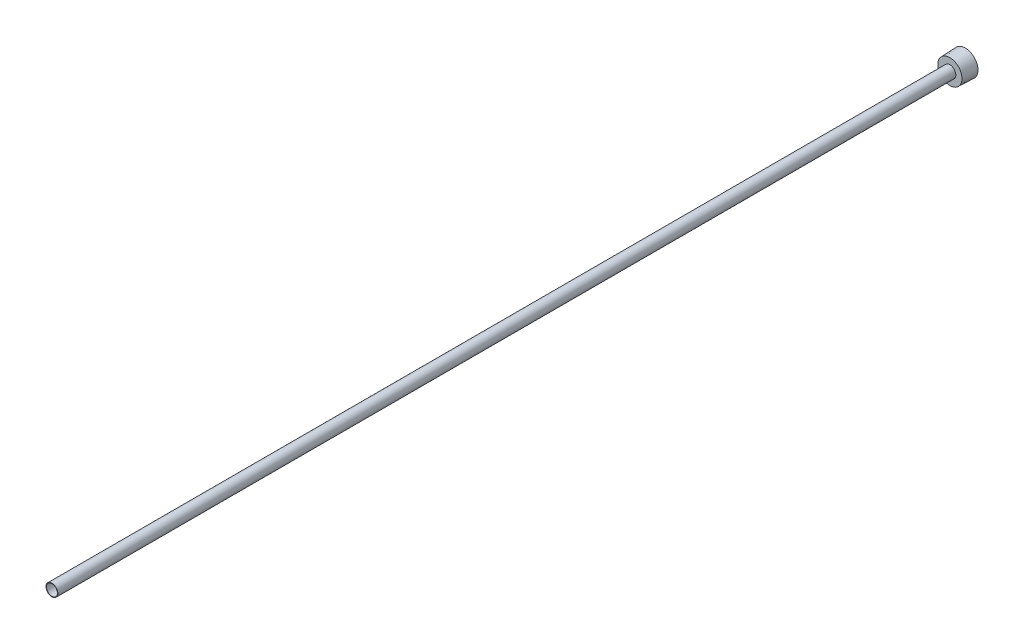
ISO-10303-21;
HEADER;
FILE_DESCRIPTION(('STEP AP214'),'2;1');
FILE_NAME('part.step','',(''),(''),'','','');
FILE_SCHEMA(('AUTOMOTIVE_DESIGN { 1 0 10303 214 1 1 1 1 }'));
ENDSEC;
DATA;
#1=APPLICATION_CONTEXT('core data for automotive mechanical design processes');
#2=APPLICATION_PROTOCOL_DEFINITION('international standard','automotive_design',2000,#1);
#3=PRODUCT_CONTEXT('',#1,'mechanical');
#4=PRODUCT('Part','Part','',(#3));
#5=PRODUCT_RELATED_PRODUCT_CATEGORY('part','',(#4));
#6=PRODUCT_DEFINITION_FORMATION('','',#4);
#7=PRODUCT_DEFINITION_CONTEXT('part definition',#1,'design');
#8=PRODUCT_DEFINITION('design','',#6,#7);
#9=PRODUCT_DEFINITION_SHAPE('','',#8);
#10=(LENGTH_UNIT() NAMED_UNIT(*) SI_UNIT(.MILLI.,.METRE.));
#11=(NAMED_UNIT(*) PLANE_ANGLE_UNIT() SI_UNIT($,.RADIAN.));
#12=(NAMED_UNIT(*) SI_UNIT($,.STERADIAN.) SOLID_ANGLE_UNIT());
#13=UNCERTAINTY_MEASURE_WITH_UNIT(LENGTH_MEASURE(1.E-05),#10,'distance_accuracy_value','');
#14=(GEOMETRIC_REPRESENTATION_CONTEXT(3) GLOBAL_UNCERTAINTY_ASSIGNED_CONTEXT((#13)) GLOBAL_UNIT_ASSIGNED_CONTEXT((#10,
#11,#12)) REPRESENTATION_CONTEXT('',''));
#15=CARTESIAN_POINT('',(0.,0.,0.));
#16=DIRECTION('',(0.,0.,1.));
#17=DIRECTION('',(1.,0.,0.));
#18=AXIS2_PLACEMENT_3D('',#15,#16,#17);
#19=CARTESIAN_POINT('',(0.,0.,0.));
#20=DIRECTION('',(0.,0.,1.));
#21=DIRECTION('',(1.,0.,0.));
#22=AXIS2_PLACEMENT_3D('',#19,#20,#21);
#23=CYLINDRICAL_SURFACE('',#22,3.6576);
#24=CARTESIAN_POINT('',(0.,0.,609.6));
#25=DIRECTION('',(0.,0.,1.));
#26=DIRECTION('',(1.,0.,0.));
#27=AXIS2_PLACEMENT_3D('',#24,#25,#26);
#28=CIRCLE('',#27,3.6576);
#29=CARTESIAN_POINT('',(3.6576,0.,609.6));
#30=VERTEX_POINT('',#29);
#31=EDGE_CURVE('E142',#30,#30,#28,.T.);
#32=CARTESIAN_POINT('',(0.,0.,6.35));
#33=DIRECTION('',(0.,0.,-1.));
#34=DIRECTION('',(-1.,0.,0.));
#35=AXIS2_PLACEMENT_3D('',#32,#33,#34);
#36=CIRCLE('',#35,3.6576);
#37=CARTESIAN_POINT('',(3.6576,0.,6.35));
#38=VERTEX_POINT('',#37);
#39=EDGE_CURVE('E37',#38,#38,#36,.F.);
#40=CARTESIAN_POINT('',(3.6576,0.,609.6));
#41=CARTESIAN_POINT('',(3.6576,0.,603.316145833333));
#42=CARTESIAN_POINT('',(3.6576,0.,597.032291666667));
#43=CARTESIAN_POINT('',(3.6576,0.,584.464583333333));
#44=CARTESIAN_POINT('',(3.6576,0.,578.180729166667));
#45=CARTESIAN_POINT('',(3.6576,0.,565.613020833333));
#46=CARTESIAN_POINT('',(3.6576,0.,559.329166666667));
#47=CARTESIAN_POINT('',(3.6576,0.,546.761458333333));
#48=CARTESIAN_POINT('',(3.6576,0.,540.477604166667));
#49=CARTESIAN_POINT('',(3.6576,0.,527.909895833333));
#50=CARTESIAN_POINT('',(3.6576,0.,521.626041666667));
#51=CARTESIAN_POINT('',(3.6576,0.,509.058333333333));
#52=CARTESIAN_POINT('',(3.6576,0.,502.774479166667));
#53=CARTESIAN_POINT('',(3.6576,0.,490.206770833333));
#54=CARTESIAN_POINT('',(3.6576,0.,483.922916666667));
#55=CARTESIAN_POINT('',(3.6576,0.,471.355208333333));
#56=CARTESIAN_POINT('',(3.6576,0.,465.071354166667));
#57=CARTESIAN_POINT('',(3.6576,0.,452.503645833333));
#58=CARTESIAN_POINT('',(3.6576,0.,446.219791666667));
#59=CARTESIAN_POINT('',(3.6576,0.,433.652083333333));
#60=CARTESIAN_POINT('',(3.6576,0.,427.368229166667));
#61=CARTESIAN_POINT('',(3.6576,0.,414.800520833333));
#62=CARTESIAN_POINT('',(3.6576,0.,408.516666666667));
#63=CARTESIAN_POINT('',(3.6576,0.,395.948958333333));
#64=CARTESIAN_POINT('',(3.6576,0.,389.665104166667));
#65=CARTESIAN_POINT('',(3.6576,0.,377.097395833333));
#66=CARTESIAN_POINT('',(3.6576,0.,370.813541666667));
#67=CARTESIAN_POINT('',(3.6576,0.,358.245833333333));
#68=CARTESIAN_POINT('',(3.6576,0.,351.961979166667));
#69=CARTESIAN_POINT('',(3.6576,0.,339.394270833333));
#70=CARTESIAN_POINT('',(3.6576,0.,333.110416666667));
#71=CARTESIAN_POINT('',(3.6576,0.,320.542708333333));
#72=CARTESIAN_POINT('',(3.6576,0.,314.258854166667));
#73=CARTESIAN_POINT('',(3.6576,0.,301.691145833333));
#74=CARTESIAN_POINT('',(3.6576,0.,295.407291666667));
#75=CARTESIAN_POINT('',(3.6576,0.,282.839583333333));
#76=CARTESIAN_POINT('',(3.6576,0.,276.555729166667));
#77=CARTESIAN_POINT('',(3.6576,0.,263.988020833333));
#78=CARTESIAN_POINT('',(3.6576,0.,257.704166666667));
#79=CARTESIAN_POINT('',(3.6576,0.,245.136458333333));
#80=CARTESIAN_POINT('',(3.6576,0.,238.852604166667));
#81=CARTESIAN_POINT('',(3.6576,0.,226.284895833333));
#82=CARTESIAN_POINT('',(3.6576,0.,220.001041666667));
#83=CARTESIAN_POINT('',(3.6576,0.,207.433333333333));
#84=CARTESIAN_POINT('',(3.6576,0.,201.149479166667));
#85=CARTESIAN_POINT('',(3.6576,0.,188.581770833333));
#86=CARTESIAN_POINT('',(3.6576,0.,182.297916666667));
#87=CARTESIAN_POINT('',(3.6576,0.,169.730208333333));
#88=CARTESIAN_POINT('',(3.6576,0.,163.446354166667));
#89=CARTESIAN_POINT('',(3.6576,0.,150.878645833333));
#90=CARTESIAN_POINT('',(3.6576,0.,144.594791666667));
#91=CARTESIAN_POINT('',(3.6576,0.,132.027083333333));
#92=CARTESIAN_POINT('',(3.6576,0.,125.743229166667));
#93=CARTESIAN_POINT('',(3.6576,0.,113.175520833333));
#94=CARTESIAN_POINT('',(3.6576,0.,106.891666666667));
#95=CARTESIAN_POINT('',(3.6576,0.,94.3239583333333));
#96=CARTESIAN_POINT('',(3.6576,0.,88.0401041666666));
#97=CARTESIAN_POINT('',(3.6576,0.,75.4723958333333));
#98=CARTESIAN_POINT('',(3.6576,0.,69.1885416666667));
#99=CARTESIAN_POINT('',(3.6576,0.,56.6208333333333));
#100=CARTESIAN_POINT('',(3.6576,0.,50.3369791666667));
#101=CARTESIAN_POINT('',(3.6576,0.,37.7692708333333));
#102=CARTESIAN_POINT('',(3.6576,0.,31.4854166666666));
#103=CARTESIAN_POINT('',(3.6576,0.,18.9177083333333));
#104=CARTESIAN_POINT('',(3.6576,0.,12.6338541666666));
#105=CARTESIAN_POINT('',(3.6576,0.,6.34999999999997));
#106=B_SPLINE_CURVE_WITH_KNOTS('',3,(#40,#41,#42,#43,#44,#45,#46,#47,#48,#49,#50,#51,#52,#53,
#54,#55,#56,#57,#58,#59,#60,#61,#62,#63,#64,#65,#66,#67,#68,#69,#70,#71,#72,#73,#74,#75,#76,#77,
#78,#79,#80,#81,#82,#83,#84,#85,#86,#87,#88,#89,#90,#91,#92,#93,#94,#95,#96,#97,#98,#99,#100,
#101,#102,#103,#104,#105),.UNSPECIFIED.,.F.,.F.,(4,2,2,2,2,2,2,2,2,2,2,2,2,2,2,2,2,2,2,2,2,2,2,
2,2,2,2,2,2,2,2,2,4),(0.,18.8515625,37.7031250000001,56.5546875,75.40625,94.2578125,113.109375,
131.9609375,150.8125,169.6640625,188.515625,207.3671875,226.21875,245.0703125,263.921875,
282.7734375,301.625,320.4765625,339.328125,358.1796875,377.03125,395.8828125,414.734375,
433.5859375,452.4375,471.2890625,490.140625,508.9921875,527.84375,546.6953125,565.546875,
584.3984375,603.25),.UNSPECIFIED.);
#107=EDGE_CURVE('BSEAM33',#30,#38,#106,.T.);
#108=ORIENTED_EDGE('',*,*,#31,.T.);
#109=ORIENTED_EDGE('',*,*,#39,.F.);
#110=ORIENTED_EDGE('',*,*,#107,.T.);
#111=ORIENTED_EDGE('',*,*,#107,.F.);
#112=EDGE_LOOP('',(#108,#110,#109,#111));
#113=FACE_BOUND('',#112,.T.);
#114=ADVANCED_FACE('F33',(#113),#23,.F.);
#115=CARTESIAN_POINT('',(0.,0.,0.));
#116=DIRECTION('',(0.,0.,-1.));
#117=DIRECTION('',(-1.,0.,0.));
#118=AXIS2_PLACEMENT_3D('',#115,#116,#117);
#119=CONICAL_SURFACE('',#118,8.4709,0.0364599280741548);
#120=CARTESIAN_POINT('',(0.,0.,10.3124));
#121=DIRECTION('',(0.,0.,1.));
#122=DIRECTION('',(1.,0.,0.));
#123=AXIS2_PLACEMENT_3D('',#120,#121,#122);
#124=CIRCLE('',#123,8.09474394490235);
#125=CARTESIAN_POINT('',(8.09474394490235,0.,10.3124));
#126=VERTEX_POINT('',#125);
#127=EDGE_CURVE('E11',#126,#126,#124,.T.);
#128=ORIENTED_EDGE('',*,*,#127,.F.);
#129=EDGE_LOOP('',(#128));
#130=FACE_BOUND('',#129,.T.);
#131=CARTESIAN_POINT('',(0.,0.,0.));
#132=DIRECTION('',(0.,0.,1.));
#133=DIRECTION('',(1.,0.,0.));
#134=AXIS2_PLACEMENT_3D('',#131,#132,#133);
#135=CIRCLE('',#134,8.4709);
#136=CARTESIAN_POINT('',(8.4709,0.,0.));
#137=VERTEX_POINT('',#136);
#138=EDGE_CURVE('E145',#137,#137,#135,.T.);
#139=ORIENTED_EDGE('',*,*,#138,.T.);
#140=EDGE_LOOP('',(#139));
#141=FACE_BOUND('',#140,.T.);
#142=ADVANCED_FACE('F35',(#130,#141),#119,.T.);
#143=CARTESIAN_POINT('',(0.,8.09474394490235,10.3124));
#144=DIRECTION('',(0.,0.,-1.));
#145=DIRECTION('',(-1.,0.,0.));
#146=AXIS2_PLACEMENT_3D('',#143,#144,#145);
#147=PLANE('',#146);
#148=CARTESIAN_POINT('',(0.,0.,10.3124));
#149=DIRECTION('',(0.,0.,1.));
#150=DIRECTION('',(1.,0.,0.));
#151=AXIS2_PLACEMENT_3D('',#148,#149,#150);
#152=CIRCLE('',#151,3.9624);
#153=CARTESIAN_POINT('',(3.9624,0.,10.3124));
#154=VERTEX_POINT('',#153);
#155=EDGE_CURVE('E42',#154,#154,#152,.T.);
#156=ORIENTED_EDGE('',*,*,#155,.F.);
#157=EDGE_LOOP('',(#156));
#158=FACE_BOUND('',#157,.T.);
#159=ORIENTED_EDGE('',*,*,#127,.T.);
#160=EDGE_LOOP('',(#159));
#161=FACE_BOUND('',#160,.T.);
#162=ADVANCED_FACE('F156',(#158,#161),#147,.F.);
#163=CARTESIAN_POINT('',(0.,0.,168.793426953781));
#164=DIRECTION('',(0.,0.,1.));
#165=DIRECTION('',(1.,0.,0.));
#166=AXIS2_PLACEMENT_3D('',#163,#164,#165);
#167=CYLINDRICAL_SURFACE('',#166,3.96239999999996);
#168=CARTESIAN_POINT('',(0.,0.,609.6));
#169=DIRECTION('',(0.,0.,1.));
#170=DIRECTION('',(1.,0.,0.));
#171=AXIS2_PLACEMENT_3D('',#168,#169,#170);
#172=CIRCLE('',#171,3.96239999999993);
#173=CARTESIAN_POINT('',(3.96239999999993,0.,609.6));
#174=VERTEX_POINT('',#173);
#175=EDGE_CURVE('E148',#174,#174,#172,.T.);
#176=ORIENTED_EDGE('',*,*,#175,.F.);
#177=EDGE_LOOP('',(#176));
#178=FACE_BOUND('',#177,.T.);
#179=ORIENTED_EDGE('',*,*,#155,.T.);
#180=EDGE_LOOP('',(#179));
#181=FACE_BOUND('',#180,.T.);
#182=ADVANCED_FACE('F154',(#178,#181),#167,.T.);
#183=CARTESIAN_POINT('',(0.,3.96239999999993,609.6));
#184=DIRECTION('',(0.,0.,-1.));
#185=DIRECTION('',(-1.,0.,0.));
#186=AXIS2_PLACEMENT_3D('',#183,#184,#185);
#187=PLANE('',#186);
#188=ORIENTED_EDGE('',*,*,#31,.F.);
#189=EDGE_LOOP('',(#188));
#190=FACE_BOUND('',#189,.T.);
#191=ORIENTED_EDGE('',*,*,#175,.T.);
#192=EDGE_LOOP('',(#191));
#193=FACE_BOUND('',#192,.T.);
#194=ADVANCED_FACE('F167',(#190,#193),#187,.F.);
#195=CARTESIAN_POINT('',(0.,0.,0.));
#196=DIRECTION('',(0.,0.,1.));
#197=DIRECTION('',(1.,0.,0.));
#198=AXIS2_PLACEMENT_3D('',#195,#196,#197);
#199=PLANE('',#198);
#200=DIRECTION('',(-0.866025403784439,-0.5,0.));
#201=VECTOR('',#200,1.);
#202=CARTESIAN_POINT('',(4.7625,-2.74963065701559,0.));
#203=LINE('',#202,#201);
#204=CARTESIAN_POINT('',(4.7625,-2.74963065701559,0.));
#205=VERTEX_POINT('',#204);
#206=CARTESIAN_POINT('',(0.,-5.49926131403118,0.));
#207=VERTEX_POINT('',#206);
#208=EDGE_CURVE('E124',#205,#207,#203,.T.);
#209=ORIENTED_EDGE('',*,*,#208,.F.);
#210=DIRECTION('',(0.,-1.,0.));
#211=VECTOR('',#210,1.);
#212=CARTESIAN_POINT('',(4.7625,2.74963065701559,0.));
#213=LINE('',#212,#211);
#214=CARTESIAN_POINT('',(4.7625,2.74963065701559,0.));
#215=VERTEX_POINT('',#214);
#216=EDGE_CURVE('E49',#215,#205,#213,.T.);
#217=ORIENTED_EDGE('',*,*,#216,.F.);
#218=DIRECTION('',(0.866025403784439,-0.5,0.));
#219=VECTOR('',#218,1.);
#220=CARTESIAN_POINT('',(0.,5.49926131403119,0.));
#221=LINE('',#220,#219);
#222=CARTESIAN_POINT('',(0.,5.49926131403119,0.));
#223=VERTEX_POINT('',#222);
#224=EDGE_CURVE('E133',#223,#215,#221,.T.);
#225=ORIENTED_EDGE('',*,*,#224,.F.);
#226=DIRECTION('',(0.866025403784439,0.5,0.));
#227=VECTOR('',#226,1.);
#228=CARTESIAN_POINT('',(-4.7625,2.7496306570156,0.));
#229=LINE('',#228,#227);
#230=CARTESIAN_POINT('',(-4.7625,2.7496306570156,0.));
#231=VERTEX_POINT('',#230);
#232=EDGE_CURVE('E131',#231,#223,#229,.T.);
#233=ORIENTED_EDGE('',*,*,#232,.F.);
#234=DIRECTION('',(0.,1.,0.));
#235=VECTOR('',#234,1.);
#236=CARTESIAN_POINT('',(-4.7625,-2.74963065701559,0.));
#237=LINE('',#236,#235);
#238=CARTESIAN_POINT('',(-4.7625,-2.74963065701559,0.));
#239=VERTEX_POINT('',#238);
#240=EDGE_CURVE('E97',#239,#231,#237,.T.);
#241=ORIENTED_EDGE('',*,*,#240,.F.);
#242=DIRECTION('',(-0.866025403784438,0.5,0.));
#243=VECTOR('',#242,1.);
#244=CARTESIAN_POINT('',(0.,-5.49926131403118,0.));
#245=LINE('',#244,#243);
#246=EDGE_CURVE('E127',#207,#239,#245,.T.);
#247=ORIENTED_EDGE('',*,*,#246,.F.);
#248=EDGE_LOOP('',(#209,#217,#225,#233,#241,#247));
#249=FACE_BOUND('',#248,.T.);
#250=ORIENTED_EDGE('',*,*,#138,.F.);
#251=EDGE_LOOP('',(#250));
#252=FACE_BOUND('',#251,.T.);
#253=ADVANCED_FACE('F165',(#249,#252),#199,.F.);
#254=CARTESIAN_POINT('',(4.7625,-2.74963065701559,6.35));
#255=DIRECTION('',(0.,0.,-1.));
#256=DIRECTION('',(-1.,0.,0.));
#257=AXIS2_PLACEMENT_3D('',#254,#255,#256);
#258=PLANE('',#257);
#259=DIRECTION('',(0.,-1.,0.));
#260=VECTOR('',#259,1.);
#261=CARTESIAN_POINT('',(4.7625,2.74963065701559,6.35));
#262=LINE('',#261,#260);
#263=CARTESIAN_POINT('',(4.7625,2.74963065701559,6.35));
#264=VERTEX_POINT('',#263);
#265=CARTESIAN_POINT('',(4.7625,-2.74963065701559,6.35));
#266=VERTEX_POINT('',#265);
#267=EDGE_CURVE('E135',#264,#266,#262,.T.);
#268=ORIENTED_EDGE('',*,*,#267,.T.);
#269=DIRECTION('',(-0.866025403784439,-0.5,0.));
#270=VECTOR('',#269,1.);
#271=CARTESIAN_POINT('',(4.7625,-2.74963065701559,6.35));
#272=LINE('',#271,#270);
#273=CARTESIAN_POINT('',(0.,-5.49926131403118,6.35));
#274=VERTEX_POINT('',#273);
#275=EDGE_CURVE('E118',#266,#274,#272,.T.);
#276=ORIENTED_EDGE('',*,*,#275,.T.);
#277=DIRECTION('',(-0.866025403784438,0.5,0.));
#278=VECTOR('',#277,1.);
#279=CARTESIAN_POINT('',(0.,-5.49926131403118,6.35));
#280=LINE('',#279,#278);
#281=CARTESIAN_POINT('',(-4.7625,-2.74963065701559,6.35));
#282=VERTEX_POINT('',#281);
#283=EDGE_CURVE('E116',#274,#282,#280,.T.);
#284=ORIENTED_EDGE('',*,*,#283,.T.);
#285=DIRECTION('',(0.,1.,0.));
#286=VECTOR('',#285,1.);
#287=CARTESIAN_POINT('',(-4.7625,-2.74963065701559,6.35));
#288=LINE('',#287,#286);
#289=CARTESIAN_POINT('',(-4.7625,2.7496306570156,6.35));
#290=VERTEX_POINT('',#289);
#291=EDGE_CURVE('E94',#282,#290,#288,.T.);
#292=ORIENTED_EDGE('',*,*,#291,.T.);
#293=DIRECTION('',(0.866025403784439,0.5,0.));
#294=VECTOR('',#293,1.);
#295=CARTESIAN_POINT('',(-4.7625,2.7496306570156,6.35));
#296=LINE('',#295,#294);
#297=CARTESIAN_POINT('',(0.,5.49926131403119,6.35));
#298=VERTEX_POINT('',#297);
#299=EDGE_CURVE('E105',#290,#298,#296,.T.);
#300=ORIENTED_EDGE('',*,*,#299,.T.);
#301=DIRECTION('',(0.866025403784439,-0.5,0.));
#302=VECTOR('',#301,1.);
#303=CARTESIAN_POINT('',(0.,5.49926131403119,6.35));
#304=LINE('',#303,#302);
#305=EDGE_CURVE('E109',#298,#264,#304,.T.);
#306=ORIENTED_EDGE('',*,*,#305,.T.);
#307=EDGE_LOOP('',(#268,#276,#284,#292,#300,#306));
#308=FACE_BOUND('',#307,.T.);
#309=ORIENTED_EDGE('',*,*,#39,.T.);
#310=EDGE_LOOP('',(#309));
#311=FACE_BOUND('',#310,.T.);
#312=ADVANCED_FACE('F112',(#308,#311),#258,.T.);
#313=CARTESIAN_POINT('',(4.7625,2.74963065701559,6.35));
#314=DIRECTION('',(1.,0.,0.));
#315=DIRECTION('',(0.,0.,-1.));
#316=AXIS2_PLACEMENT_3D('',#313,#314,#315);
#317=PLANE('',#316);
#318=ORIENTED_EDGE('',*,*,#216,.T.);
#319=DIRECTION('',(0.,0.,-1.));
#320=VECTOR('',#319,1.);
#321=CARTESIAN_POINT('',(4.7625,-2.74963065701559,6.35));
#322=LINE('',#321,#320);
#323=EDGE_CURVE('E79',#266,#205,#322,.T.);
#324=ORIENTED_EDGE('',*,*,#323,.F.);
#325=ORIENTED_EDGE('',*,*,#267,.F.);
#326=DIRECTION('',(0.,0.,-1.));
#327=VECTOR('',#326,1.);
#328=CARTESIAN_POINT('',(4.7625,2.74963065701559,6.35));
#329=LINE('',#328,#327);
#330=EDGE_CURVE('E57',#264,#215,#329,.T.);
#331=ORIENTED_EDGE('',*,*,#330,.T.);
#332=EDGE_LOOP('',(#318,#324,#325,#331));
#333=FACE_BOUND('',#332,.T.);
#334=ADVANCED_FACE('F174',(#333),#317,.F.);
#335=CARTESIAN_POINT('',(0.,5.49926131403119,6.35));
#336=DIRECTION('',(0.5,0.866025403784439,0.));
#337=DIRECTION('',(-0.866025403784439,0.5,0.));
#338=AXIS2_PLACEMENT_3D('',#335,#336,#337);
#339=PLANE('',#338);
#340=ORIENTED_EDGE('',*,*,#224,.T.);
#341=ORIENTED_EDGE('',*,*,#330,.F.);
#342=ORIENTED_EDGE('',*,*,#305,.F.);
#343=DIRECTION('',(0.,0.,-1.));
#344=VECTOR('',#343,1.);
#345=CARTESIAN_POINT('',(0.,5.49926131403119,6.35));
#346=LINE('',#345,#344);
#347=EDGE_CURVE('E101',#298,#223,#346,.T.);
#348=ORIENTED_EDGE('',*,*,#347,.T.);
#349=EDGE_LOOP('',(#340,#341,#342,#348));
#350=FACE_BOUND('',#349,.T.);
#351=ADVANCED_FACE('F188',(#350),#339,.F.);
#352=CARTESIAN_POINT('',(-4.7625,2.7496306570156,6.35));
#353=DIRECTION('',(-0.5,0.866025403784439,0.));
#354=DIRECTION('',(-0.866025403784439,-0.5,0.));
#355=AXIS2_PLACEMENT_3D('',#352,#353,#354);
#356=PLANE('',#355);
#357=ORIENTED_EDGE('',*,*,#232,.T.);
#358=ORIENTED_EDGE('',*,*,#347,.F.);
#359=ORIENTED_EDGE('',*,*,#299,.F.);
#360=DIRECTION('',(0.,0.,-1.));
#361=VECTOR('',#360,1.);
#362=CARTESIAN_POINT('',(-4.7625,2.7496306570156,6.35));
#363=LINE('',#362,#361);
#364=EDGE_CURVE('E90',#290,#231,#363,.T.);
#365=ORIENTED_EDGE('',*,*,#364,.T.);
#366=EDGE_LOOP('',(#357,#358,#359,#365));
#367=FACE_BOUND('',#366,.T.);
#368=ADVANCED_FACE('F106',(#367),#356,.F.);
#369=CARTESIAN_POINT('',(-4.7625,-2.74963065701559,6.35));
#370=DIRECTION('',(-1.,0.,0.));
#371=DIRECTION('',(0.,-1.,0.));
#372=AXIS2_PLACEMENT_3D('',#369,#370,#371);
#373=PLANE('',#372);
#374=ORIENTED_EDGE('',*,*,#240,.T.);
#375=ORIENTED_EDGE('',*,*,#364,.F.);
#376=ORIENTED_EDGE('',*,*,#291,.F.);
#377=DIRECTION('',(0.,0.,-1.));
#378=VECTOR('',#377,1.);
#379=CARTESIAN_POINT('',(-4.7625,-2.74963065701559,6.35));
#380=LINE('',#379,#378);
#381=EDGE_CURVE('E102',#282,#239,#380,.T.);
#382=ORIENTED_EDGE('',*,*,#381,.T.);
#383=EDGE_LOOP('',(#374,#375,#376,#382));
#384=FACE_BOUND('',#383,.T.);
#385=ADVANCED_FACE('F92',(#384),#373,.F.);
#386=CARTESIAN_POINT('',(0.,-5.49926131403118,6.35));
#387=DIRECTION('',(-0.5,-0.866025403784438,0.));
#388=DIRECTION('',(0.866025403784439,-0.5,0.));
#389=AXIS2_PLACEMENT_3D('',#386,#387,#388);
#390=PLANE('',#389);
#391=ORIENTED_EDGE('',*,*,#246,.T.);
#392=ORIENTED_EDGE('',*,*,#381,.F.);
#393=ORIENTED_EDGE('',*,*,#283,.F.);
#394=DIRECTION('',(0.,0.,-1.));
#395=VECTOR('',#394,1.);
#396=CARTESIAN_POINT('',(0.,-5.49926131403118,6.35));
#397=LINE('',#396,#395);
#398=EDGE_CURVE('E139',#274,#207,#397,.T.);
#399=ORIENTED_EDGE('',*,*,#398,.T.);
#400=EDGE_LOOP('',(#391,#392,#393,#399));
#401=FACE_BOUND('',#400,.T.);
#402=ADVANCED_FACE('F192',(#401),#390,.F.);
#403=CARTESIAN_POINT('',(4.7625,-2.74963065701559,6.35));
#404=DIRECTION('',(0.5,-0.866025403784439,0.));
#405=DIRECTION('',(0.866025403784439,0.5,0.));
#406=AXIS2_PLACEMENT_3D('',#403,#404,#405);
#407=PLANE('',#406);
#408=ORIENTED_EDGE('',*,*,#208,.T.);
#409=ORIENTED_EDGE('',*,*,#398,.F.);
#410=ORIENTED_EDGE('',*,*,#275,.F.);
#411=ORIENTED_EDGE('',*,*,#323,.T.);
#412=EDGE_LOOP('',(#408,#409,#410,#411));
#413=FACE_BOUND('',#412,.T.);
#414=ADVANCED_FACE('F189',(#413),#407,.F.);
#415=CLOSED_SHELL('',(#114,#142,#162,#182,#194,#253,#312,#334,#351,#368,#385,#402,#414));
#416=MANIFOLD_SOLID_BREP('B2',#415);
#417=ADVANCED_BREP_SHAPE_REPRESENTATION('',(#18,#416),#14);
#418=SHAPE_DEFINITION_REPRESENTATION(#9,#417);
ENDSEC;
END-ISO-10303-21;
